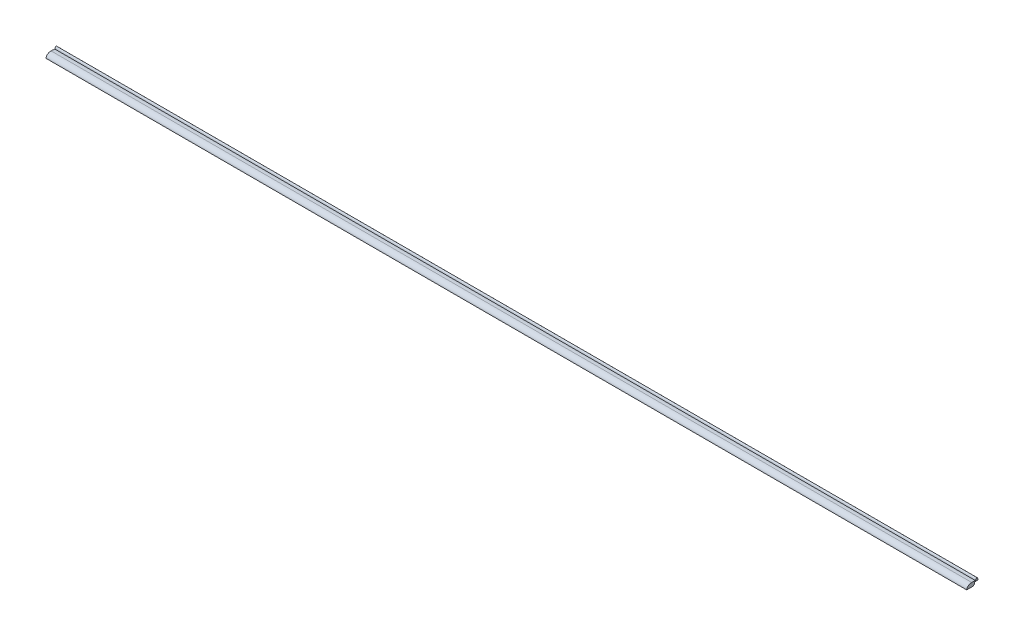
from build123d import *

# Parameters (mm, degrees)
EXTRUDE1_DEPTH = 113.203


with BuildPart() as part:
    # Sketch1 → Extrude1 (new, symmetric)
    with BuildSketch(Plane(origin=(0, -7.7395, -7.7395), x_dir=(0, -1, 0), z_dir=(1, 0, 0))):
        with BuildLine():
            Line((-7.7395, -9.4085), (-7.7395, -7.7395))
            Line((-7.7395, -7.7395), (-7.9595, -7.7395))
            Line((-7.9595, -7.7395), (-7.9595, -7.5295))
            Line((-7.9595, -7.5295), (-8.4595, -7.5295))
            Line((-8.4595, -7.5295), (-8.4595, -6.6295))
            add(Edge.make_bspline(
                [(-8.4595, -6.6295), (-9.022988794, -6.6295), (-9.094347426, -6.891508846), (-9.165706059, -7.153517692), (-8.620290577, -7.219877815)],
                knots=[4.71238898, 4.71238898, 4.71238898, 6.156207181, 6.156207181, 7.600025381, 7.600025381, 7.600025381], degree=2, weights=[1, 0.750545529, 1, 0.750545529, 1]))
            add(Edge.make_bspline(
                [(-8.620290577, -7.219877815), (-8.7095, -7.591380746), (-8.7095, -8.169)],
                knots=[0.698620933, 0.698620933, 0.698620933, 1.570796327, 1.570796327, 1.570796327], degree=2, weights=[1, 0.906411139, 1]))
            add(Edge.make_bspline(
                [(-8.7095, -8.169), (-8.7095, -9.4085), (-7.7395, -9.4085)],
                knots=[1.570796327, 1.570796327, 1.570796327, 3.141592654, 3.141592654, 3.141592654], degree=2, weights=[1, 0.707106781, 1]))
        make_face()
    extrude(amount=EXTRUDE1_DEPTH, both=True)


solid = part.part
